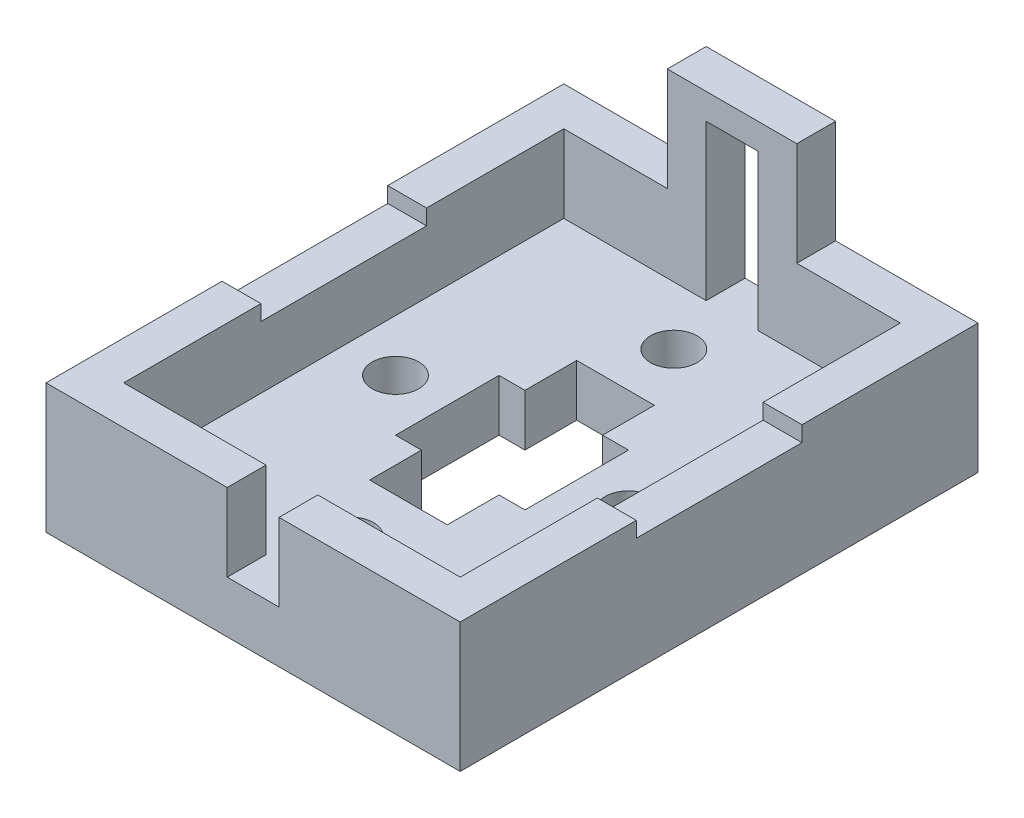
from build123d import *

# Parameters (mm, degrees)
SKETCH1_W                  = 80
SKETCH1_H                  = 100
EXTRUDE1_DEPTH             = 25
SKETCH2_W                  = 65
SKETCH2_H                  = 85
CUT_EXTRUDE1_DEPTH         = 15
SKETCH3_W                  = 25
SKETCH3_H                  = 7.5
EXTRUDE2_DEPTH             = 20
SKETCH4_W                  = 7.5
SKETCH4_H                  = 32
CUT_EXTRUDE2_DEPTH         = 3
SKETCH4_4_W                = 10
SKETCH4_4_H                = 7.5
CUT_EXTRUDE3_DEPTH         = 15
CUT_EXTRUDE4_DEPTH         = 133.759180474
SKETCH6_W                  = 10
SKETCH6_H                  = 30
CUT_EXTRUDE5_DEPTH         = 131.312125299
M10X1_0_TAPPED_HOLE1_D     = 9
M10X1_0_TAPPED_HOLE1_DEPTH = 23
M10X1_0_TAPPED_HOLE1_TIP   = 2.703872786


with BuildPart() as part:
    # Sketch1 → Extrude1 (new body)
    with BuildSketch(Plane(origin=(0, 0, 0), x_dir=(1, 0, 0), z_dir=(0, 1, 0))):
        with Locations((40, 50)):
            Rectangle(SKETCH1_W, SKETCH1_H)
    extrude(amount=EXTRUDE1_DEPTH)

    # Sketch2 → Cut-Extrude1 (cut)
    with BuildSketch(Plane(origin=(0, 25, 0), x_dir=(-1, 0, 0), z_dir=(0, 1, 0))):
        with Locations((-40, -50)):
            Rectangle(SKETCH2_W, SKETCH2_H)
    extrude(amount=-CUT_EXTRUDE1_DEPTH, mode=Mode.SUBTRACT)

    # Sketch3 → Extrude2 (add)
    with BuildSketch(Plane(origin=(0, 25, 0), x_dir=(-1, 0, 0), z_dir=(0, 1, 0))):
        with Locations((-40, -96.25)):
            Rectangle(SKETCH3_W, SKETCH3_H)
    extrude(amount=EXTRUDE2_DEPTH)

    # Sketch4 → Cut-Extrude2 (cut)
    with BuildSketch(Plane(origin=(0, 25, 0), x_dir=(-1, 0, 0), z_dir=(0, 1, 0))):
        with Locations((-3.75, -50)):
            Rectangle(SKETCH4_W, SKETCH4_H)
        with Locations((-76.25, -50)):
            Rectangle(SKETCH4_W, SKETCH4_H)
    extrude(amount=-CUT_EXTRUDE2_DEPTH, mode=Mode.SUBTRACT)

    # Sketch4_4 → Cut-Extrude3 (cut)
    with BuildSketch(Plane(origin=(0, 25, 0), x_dir=(-1, 0, 0), z_dir=(0, 1, 0))):
        with Locations((-40, -3.75)):
            Rectangle(SKETCH4_4_W, SKETCH4_4_H)
    extrude(amount=-CUT_EXTRUDE3_DEPTH, mode=Mode.SUBTRACT)

    # Sketch5 → Cut-Extrude4 (cut, through all)
    with BuildSketch(Plane(origin=(0, 10, 0), x_dir=(-1, 0, 0), z_dir=(0, 1, 0))):
        Polygon((-27.5, -40), (-27.5, -60), (-32.5, -60), (-32.5, -70), (-47.5, -70), (-47.5, -60), (-52.5, -60), (-52.5, -40), (-47.5, -40), (-47.5, -30), (-32.5, -30), (-32.5, -40), align=None)
    extrude(amount=-CUT_EXTRUDE4_DEPTH, mode=Mode.SUBTRACT)

    # Sketch6 → Cut-Extrude5 (cut, through all)
    with BuildSketch(Plane.XY.offset(-92.5)):
        with Locations((40, 25)):
            Rectangle(SKETCH6_W, SKETCH6_H)
    extrude(amount=-CUT_EXTRUDE5_DEPTH, mode=Mode.SUBTRACT)

    # M10x1.0 Tapped Hole1
    with Locations(Plane(origin=(0, 10, 0), x_dir=(-1, 0, 0), z_dir=(0, 1, 0))):
        with Locations((-17.5, -50), (-40, -81.25), (-62.5, -50), (-40, -18.75)):
            Hole(M10X1_0_TAPPED_HOLE1_D / 2, depth=M10X1_0_TAPPED_HOLE1_DEPTH)
            with Locations((0, 0, -(M10X1_0_TAPPED_HOLE1_DEPTH + M10X1_0_TAPPED_HOLE1_TIP / 2))):  # 118° drill point
                Cone(0, M10X1_0_TAPPED_HOLE1_D / 2, M10X1_0_TAPPED_HOLE1_TIP, mode=Mode.SUBTRACT)


solid = part.part
